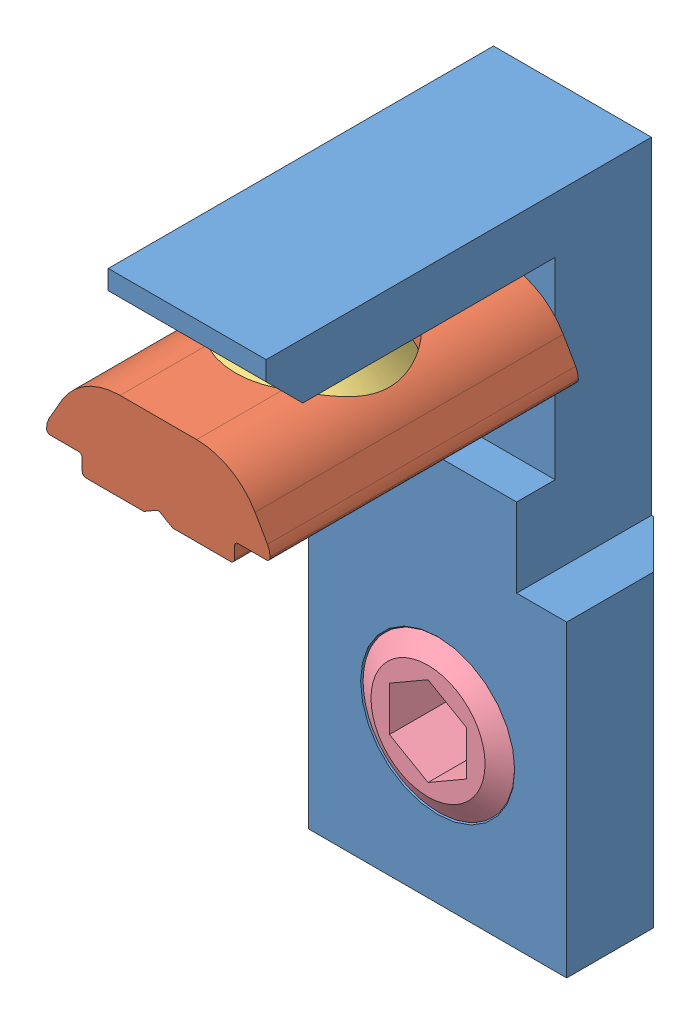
SolidWorks assembly 21.0033 POWER-LOCK FASTENER N30.SLDASM, configuration Default (file format 3800). Lengths in mm.
Overall size (13.4 33 22).
4 component instances, 4 part files, 7 mates.
Components (placement in the parent):
- 21.0033 POWER-LOCK FASTENER N30-1: 21.0033 POWER-LOCK FASTENER N30.SLDPRT [Default] at origin size (13.4 33 20)
- 21.0033 M8 NUT-1: 21.0033 M8 NUT.SLDPRT [Default] at origin size (11.6 4.6 16)
- 21.0033 M8X6 SET SCREW-1: 21.0033 M8X6 SET SCREW.SLDPRT [Default] at (0 1.5 0) size (8 6 8)
- 21.0033 M8X8 SET SCREW-1: 21.0033 M8X8 SET SCREW.SLDPRT [Default] at (0 -6.5 15.5) x (1 0 0) z (0 1 0) size (8 8 8)
Mates (geometry in assembly coordinates):
- Angle2: planar angle aligned: plane of ? through (-4.1 8 0) normal (0 0 1); plane of ? through (-1.8788 22.5915 14.5) normal (0 0 1)
- Concentric2: concentric: cone of ?; cylinder of ?
- Distance2: distance = 7.5 mm: plane of ? through (4.15 17.5 14.5) normal (0 -1 0); plane of ? through (4.1 25 13) normal (0 1 0)
- Concentric3: concentric: cylinder of ?; cylinder of ?
- Coincident3: coincident aligned: plane of ? through (-3.75 16.5 14.5) normal (0 -1 0); plane of ? through (-1.4804 3.9721 6.5) normal (0 -1 0)
- Concentric4: concentric anti-aligned: cylinder of ?; cylinder of ?
- Distance3: distance = 7.5 mm anti-aligned: plane of 21.0033 M8X8 SET SCREW-1 through (-0.5 0 -7.5) normal (0 0 -1); plane of ? through (-4.1 8 0) normal (0 0 1)
